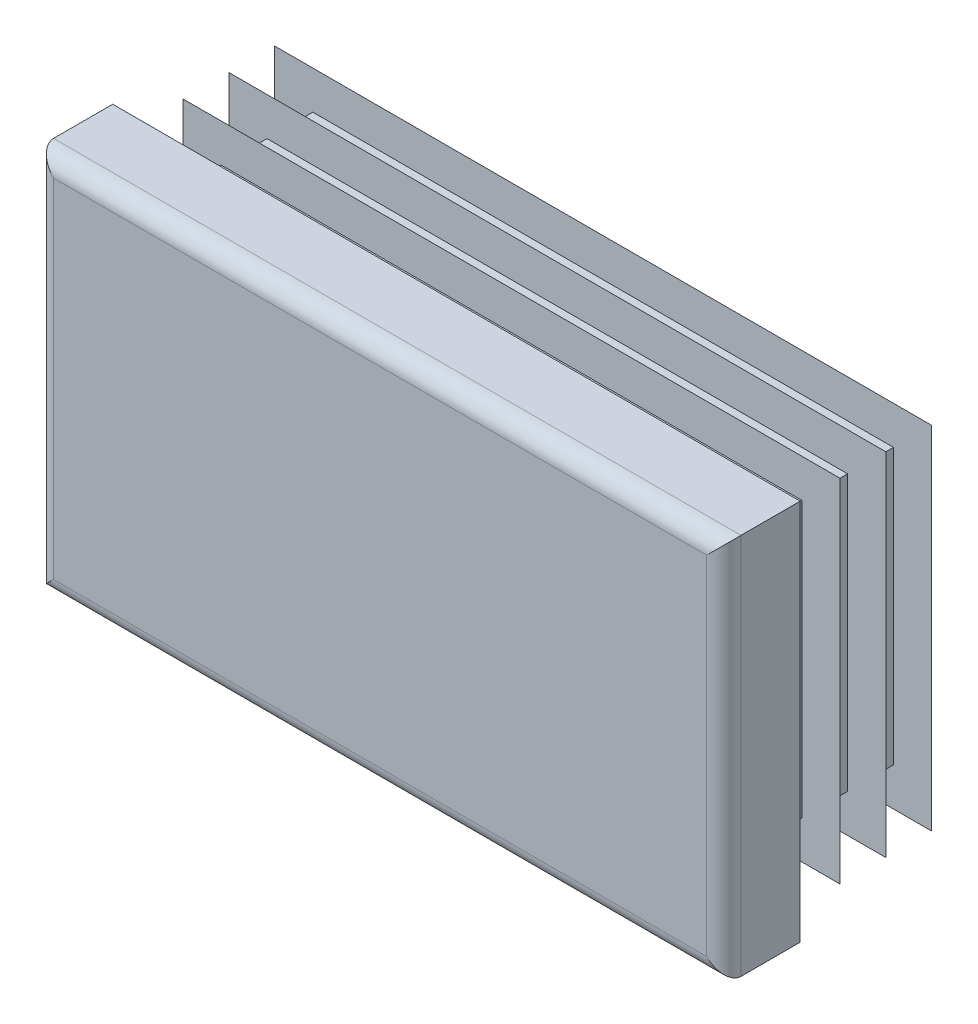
ISO-10303-21;
HEADER;
FILE_DESCRIPTION(('STEP AP214'),'2;1');
FILE_NAME('part.step','',(''),(''),'','','');
FILE_SCHEMA(('AUTOMOTIVE_DESIGN { 1 0 10303 214 1 1 1 1 }'));
ENDSEC;
DATA;
#1=APPLICATION_CONTEXT('core data for automotive mechanical design processes');
#2=APPLICATION_PROTOCOL_DEFINITION('international standard','automotive_design',2000,#1);
#3=PRODUCT_CONTEXT('',#1,'mechanical');
#4=PRODUCT('Part','Part','',(#3));
#5=PRODUCT_RELATED_PRODUCT_CATEGORY('part','',(#4));
#6=PRODUCT_DEFINITION_FORMATION('','',#4);
#7=PRODUCT_DEFINITION_CONTEXT('part definition',#1,'design');
#8=PRODUCT_DEFINITION('design','',#6,#7);
#9=PRODUCT_DEFINITION_SHAPE('','',#8);
#10=(LENGTH_UNIT() NAMED_UNIT(*) SI_UNIT(.MILLI.,.METRE.));
#11=(NAMED_UNIT(*) PLANE_ANGLE_UNIT() SI_UNIT($,.RADIAN.));
#12=(NAMED_UNIT(*) SI_UNIT($,.STERADIAN.) SOLID_ANGLE_UNIT());
#13=UNCERTAINTY_MEASURE_WITH_UNIT(LENGTH_MEASURE(1.E-05),#10,'distance_accuracy_value','');
#14=(GEOMETRIC_REPRESENTATION_CONTEXT(3) GLOBAL_UNCERTAINTY_ASSIGNED_CONTEXT((#13)) GLOBAL_UNIT_ASSIGNED_CONTEXT((#10,
#11,#12)) REPRESENTATION_CONTEXT('',''));
#15=CARTESIAN_POINT('',(0.,0.,0.));
#16=DIRECTION('',(0.,0.,1.));
#17=DIRECTION('',(1.,0.,0.));
#18=AXIS2_PLACEMENT_3D('',#15,#16,#17);
#19=CARTESIAN_POINT('',(21.375,-12.5,5.));
#20=DIRECTION('',(0.,0.,-1.));
#21=DIRECTION('',(0.,1.,0.));
#22=AXIS2_PLACEMENT_3D('',#19,#20,#21);
#23=PLANE('',#22);
#24=DIRECTION('',(0.,1.,0.));
#25=VECTOR('',#24,1.);
#26=CARTESIAN_POINT('',(-21.375,-12.5,5.));
#27=LINE('',#26,#25);
#28=CARTESIAN_POINT('',(-21.375,-11.375,5.));
#29=VERTEX_POINT('',#28);
#30=CARTESIAN_POINT('',(-21.375,11.375,5.));
#31=VERTEX_POINT('',#30);
#32=EDGE_CURVE('E310',#29,#31,#27,.T.);
#33=ORIENTED_EDGE('',*,*,#32,.F.);
#34=DIRECTION('',(-1.,0.,0.));
#35=VECTOR('',#34,1.);
#36=CARTESIAN_POINT('',(22.5,-11.375,5.));
#37=LINE('',#36,#35);
#38=CARTESIAN_POINT('',(21.375,-11.375,5.));
#39=VERTEX_POINT('',#38);
#40=EDGE_CURVE('E482',#39,#29,#37,.T.);
#41=ORIENTED_EDGE('',*,*,#40,.F.);
#42=DIRECTION('',(0.,1.,0.));
#43=VECTOR('',#42,1.);
#44=CARTESIAN_POINT('',(21.375,-12.5,5.));
#45=LINE('',#44,#43);
#46=CARTESIAN_POINT('',(21.375,11.375,5.));
#47=VERTEX_POINT('',#46);
#48=EDGE_CURVE('E305',#39,#47,#45,.T.);
#49=ORIENTED_EDGE('',*,*,#48,.T.);
#50=DIRECTION('',(-1.,0.,0.));
#51=VECTOR('',#50,1.);
#52=CARTESIAN_POINT('',(22.5,11.375,5.));
#53=LINE('',#52,#51);
#54=EDGE_CURVE('E630',#47,#31,#53,.T.);
#55=ORIENTED_EDGE('',*,*,#54,.T.);
#56=EDGE_LOOP('',(#33,#41,#49,#55));
#57=FACE_BOUND('',#56,.T.);
#58=ADVANCED_FACE('F14',(#57),#23,.F.);
#59=CARTESIAN_POINT('',(-21.375,-12.5,3.875));
#60=DIRECTION('',(0.,1.,0.));
#61=DIRECTION('',(-1.,0.,0.));
#62=AXIS2_PLACEMENT_3D('',#59,#60,#61);
#63=CYLINDRICAL_SURFACE('',#62,1.125);
#64=DIRECTION('',(0.,1.,0.));
#65=VECTOR('',#64,1.);
#66=CARTESIAN_POINT('',(-22.5,-12.5,3.875));
#67=LINE('',#66,#65);
#68=CARTESIAN_POINT('',(-22.5,-12.5,3.875));
#69=VERTEX_POINT('',#68);
#70=CARTESIAN_POINT('',(-22.5,12.5,3.875));
#71=VERTEX_POINT('',#70);
#72=EDGE_CURVE('E402',#69,#71,#67,.T.);
#73=ORIENTED_EDGE('',*,*,#72,.F.);
#74=CARTESIAN_POINT('',(-21.375,-11.375,3.875));
#75=DIRECTION('',(-0.707106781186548,0.707106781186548,0.));
#76=DIRECTION('',(0.707106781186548,0.707106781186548,0.));
#77=AXIS2_PLACEMENT_3D('',#74,#75,#76);
#78=ELLIPSE('',#77,1.59099025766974,1.125);
#79=EDGE_CURVE('E59',#69,#29,#78,.T.);
#80=ORIENTED_EDGE('',*,*,#79,.T.);
#81=ORIENTED_EDGE('',*,*,#32,.T.);
#82=CARTESIAN_POINT('',(-21.375,11.375,3.875));
#83=DIRECTION('',(0.707106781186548,0.707106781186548,0.));
#84=DIRECTION('',(-0.707106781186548,0.707106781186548,0.));
#85=AXIS2_PLACEMENT_3D('',#82,#83,#84);
#86=ELLIPSE('',#85,1.59099025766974,1.125);
#87=EDGE_CURVE('E306',#31,#71,#86,.F.);
#88=ORIENTED_EDGE('',*,*,#87,.T.);
#89=EDGE_LOOP('',(#73,#80,#81,#88));
#90=FACE_BOUND('',#89,.T.);
#91=ADVANCED_FACE('F16',(#90),#63,.T.);
#92=CARTESIAN_POINT('',(-22.5,-12.5,3.875));
#93=DIRECTION('',(1.,0.,0.));
#94=DIRECTION('',(0.,1.,0.));
#95=AXIS2_PLACEMENT_3D('',#92,#93,#94);
#96=PLANE('',#95);
#97=DIRECTION('',(0.,0.,-1.));
#98=VECTOR('',#97,1.);
#99=CARTESIAN_POINT('',(-22.5,12.5,3.875));
#100=LINE('',#99,#98);
#101=CARTESIAN_POINT('',(-22.5,12.5,0.));
#102=VERTEX_POINT('',#101);
#103=EDGE_CURVE('E615',#71,#102,#100,.T.);
#104=ORIENTED_EDGE('',*,*,#103,.T.);
#105=DIRECTION('',(0.,1.,0.));
#106=VECTOR('',#105,1.);
#107=CARTESIAN_POINT('',(-22.5,-12.5,0.));
#108=LINE('',#107,#106);
#109=CARTESIAN_POINT('',(-22.5,-12.5,0.));
#110=VERTEX_POINT('',#109);
#111=EDGE_CURVE('E400',#110,#102,#108,.T.);
#112=ORIENTED_EDGE('',*,*,#111,.F.);
#113=DIRECTION('',(0.,0.,-1.));
#114=VECTOR('',#113,1.);
#115=CARTESIAN_POINT('',(-22.5,-12.5,3.875));
#116=LINE('',#115,#114);
#117=EDGE_CURVE('E616',#69,#110,#116,.T.);
#118=ORIENTED_EDGE('',*,*,#117,.F.);
#119=ORIENTED_EDGE('',*,*,#72,.T.);
#120=EDGE_LOOP('',(#104,#112,#118,#119));
#121=FACE_BOUND('',#120,.T.);
#122=ADVANCED_FACE('F697',(#121),#96,.F.);
#123=CARTESIAN_POINT('',(-19.,-12.5,0.));
#124=DIRECTION('',(1.,0.,0.));
#125=DIRECTION('',(0.,1.,0.));
#126=AXIS2_PLACEMENT_3D('',#123,#124,#125);
#127=PLANE('',#126);
#128=DIRECTION('',(0.,1.,0.));
#129=VECTOR('',#128,1.);
#130=CARTESIAN_POINT('',(-19.,-12.5,0.));
#131=LINE('',#130,#129);
#132=CARTESIAN_POINT('',(-19.,-9.,0.));
#133=VERTEX_POINT('',#132);
#134=CARTESIAN_POINT('',(-19.,9.,0.));
#135=VERTEX_POINT('',#134);
#136=EDGE_CURVE('E397',#133,#135,#131,.T.);
#137=ORIENTED_EDGE('',*,*,#136,.T.);
#138=DIRECTION('',(0.,0.,-1.));
#139=VECTOR('',#138,1.);
#140=CARTESIAN_POINT('',(-19.,9.,0.));
#141=LINE('',#140,#139);
#142=CARTESIAN_POINT('',(-19.,9.,-0.6));
#143=VERTEX_POINT('',#142);
#144=EDGE_CURVE('E495',#135,#143,#141,.T.);
#145=ORIENTED_EDGE('',*,*,#144,.T.);
#146=DIRECTION('',(0.,1.,0.));
#147=VECTOR('',#146,1.);
#148=CARTESIAN_POINT('',(-19.,-12.5,-0.6));
#149=LINE('',#148,#147);
#150=CARTESIAN_POINT('',(-19.,-9.,-0.6));
#151=VERTEX_POINT('',#150);
#152=EDGE_CURVE('E394',#151,#143,#149,.T.);
#153=ORIENTED_EDGE('',*,*,#152,.F.);
#154=DIRECTION('',(0.,0.,1.));
#155=VECTOR('',#154,1.);
#156=CARTESIAN_POINT('',(-19.,-9.,0.));
#157=LINE('',#156,#155);
#158=EDGE_CURVE('E489',#151,#133,#157,.T.);
#159=ORIENTED_EDGE('',*,*,#158,.T.);
#160=EDGE_LOOP('',(#137,#145,#153,#159));
#161=FACE_BOUND('',#160,.T.);
#162=ADVANCED_FACE('F787',(#161),#127,.F.);
#163=CARTESIAN_POINT('',(-21.5,-12.5,-0.6));
#164=DIRECTION('',(0.342020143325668,0.,0.939692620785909));
#165=DIRECTION('',(-0.939692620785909,0.,0.342020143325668));
#166=AXIS2_PLACEMENT_3D('',#163,#164,#165);
#167=PLANE('',#166);
#168=DIRECTION('',(0.,1.,0.));
#169=VECTOR('',#168,1.);
#170=CARTESIAN_POINT('',(-21.5,-12.5,-0.6));
#171=LINE('',#170,#169);
#172=CARTESIAN_POINT('',(-21.5,-11.5,-0.6));
#173=VERTEX_POINT('',#172);
#174=CARTESIAN_POINT('',(-21.5,11.5,-0.6));
#175=VERTEX_POINT('',#174);
#176=EDGE_CURVE('E392',#173,#175,#171,.T.);
#177=ORIENTED_EDGE('',*,*,#176,.T.);
#178=DIRECTION('',(0.844349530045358,-0.43889572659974,-0.307318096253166));
#179=VECTOR('',#178,1.);
#180=CARTESIAN_POINT('',(-12.6060463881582,6.87689298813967,-3.83713437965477));
#181=LINE('',#180,#179);
#182=CARTESIAN_POINT('',(-19.,10.2004915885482,-1.5099255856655));
#183=VERTEX_POINT('',#182);
#184=EDGE_CURVE('E519',#175,#183,#181,.T.);
#185=ORIENTED_EDGE('',*,*,#184,.T.);
#186=DIRECTION('',(0.,1.,0.));
#187=VECTOR('',#186,1.);
#188=CARTESIAN_POINT('',(-19.,-12.5,-1.5099255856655));
#189=LINE('',#188,#187);
#190=CARTESIAN_POINT('',(-19.,-10.2004915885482,-1.5099255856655));
#191=VERTEX_POINT('',#190);
#192=EDGE_CURVE('E389',#191,#183,#189,.T.);
#193=ORIENTED_EDGE('',*,*,#192,.F.);
#194=DIRECTION('',(-0.844349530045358,-0.438895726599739,0.307318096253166));
#195=VECTOR('',#194,1.);
#196=CARTESIAN_POINT('',(-21.8705814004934,-11.6926294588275,-0.465119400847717));
#197=LINE('',#196,#195);
#198=EDGE_CURVE('E507',#191,#173,#197,.T.);
#199=ORIENTED_EDGE('',*,*,#198,.T.);
#200=EDGE_LOOP('',(#177,#185,#193,#199));
#201=FACE_BOUND('',#200,.T.);
#202=ADVANCED_FACE('F783',(#201),#167,.F.);
#203=CARTESIAN_POINT('',(-19.,-12.5,-1.5099255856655));
#204=DIRECTION('',(1.,0.,0.));
#205=DIRECTION('',(0.,1.,0.));
#206=AXIS2_PLACEMENT_3D('',#203,#204,#205);
#207=PLANE('',#206);
#208=ORIENTED_EDGE('',*,*,#192,.T.);
#209=DIRECTION('',(0.,-0.819152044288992,-0.573576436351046));
#210=VECTOR('',#209,1.);
#211=CARTESIAN_POINT('',(-19.,-5.0317668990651,-12.1756678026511));
#212=LINE('',#211,#210);
#213=CARTESIAN_POINT('',(-19.,9.,-2.35051884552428));
#214=VERTEX_POINT('',#213);
#215=EDGE_CURVE('E516',#183,#214,#212,.T.);
#216=ORIENTED_EDGE('',*,*,#215,.T.);
#217=DIRECTION('',(0.,0.,-1.));
#218=VECTOR('',#217,1.);
#219=CARTESIAN_POINT('',(-19.,9.,-1.5099255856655));
#220=LINE('',#219,#218);
#221=CARTESIAN_POINT('',(-19.,9.,-3.6));
#222=VERTEX_POINT('',#221);
#223=EDGE_CURVE('E525',#214,#222,#220,.T.);
#224=ORIENTED_EDGE('',*,*,#223,.T.);
#225=DIRECTION('',(0.,1.,0.));
#226=VECTOR('',#225,1.);
#227=CARTESIAN_POINT('',(-19.,-12.5,-3.6));
#228=LINE('',#227,#226);
#229=CARTESIAN_POINT('',(-19.,-9.,-3.6));
#230=VERTEX_POINT('',#229);
#231=EDGE_CURVE('E386',#230,#222,#228,.T.);
#232=ORIENTED_EDGE('',*,*,#231,.F.);
#233=DIRECTION('',(0.,0.,1.));
#234=VECTOR('',#233,1.);
#235=CARTESIAN_POINT('',(-19.,-9.,-1.5099255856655));
#236=LINE('',#235,#234);
#237=CARTESIAN_POINT('',(-19.,-9.,-2.35051884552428));
#238=VERTEX_POINT('',#237);
#239=EDGE_CURVE('E522',#230,#238,#236,.T.);
#240=ORIENTED_EDGE('',*,*,#239,.T.);
#241=DIRECTION('',(0.,-0.819152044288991,0.573576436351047));
#242=VECTOR('',#241,1.);
#243=CARTESIAN_POINT('',(-19.,-11.7434848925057,-0.429510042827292));
#244=LINE('',#243,#242);
#245=EDGE_CURVE('E504',#238,#191,#244,.T.);
#246=ORIENTED_EDGE('',*,*,#245,.T.);
#247=EDGE_LOOP('',(#208,#216,#224,#232,#240,#246));
#248=FACE_BOUND('',#247,.T.);
#249=ADVANCED_FACE('F779',(#248),#207,.F.);
#250=CARTESIAN_POINT('',(-21.5,-12.5,-3.6));
#251=DIRECTION('',(0.34202014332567,0.,0.939692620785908));
#252=DIRECTION('',(-0.939692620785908,0.,0.34202014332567));
#253=AXIS2_PLACEMENT_3D('',#250,#251,#252);
#254=PLANE('',#253);
#255=DIRECTION('',(0.,1.,0.));
#256=VECTOR('',#255,1.);
#257=CARTESIAN_POINT('',(-21.5,-12.5,-3.6));
#258=LINE('',#257,#256);
#259=CARTESIAN_POINT('',(-21.5,-11.5,-3.6));
#260=VERTEX_POINT('',#259);
#261=CARTESIAN_POINT('',(-21.5,11.5,-3.6));
#262=VERTEX_POINT('',#261);
#263=EDGE_CURVE('E384',#260,#262,#258,.T.);
#264=ORIENTED_EDGE('',*,*,#263,.T.);
#265=DIRECTION('',(0.844349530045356,-0.438895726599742,-0.307318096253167));
#266=VECTOR('',#265,1.);
#267=CARTESIAN_POINT('',(-12.6060463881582,6.87689298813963,-6.8371343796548));
#268=LINE('',#267,#266);
#269=CARTESIAN_POINT('',(-19.,10.2004915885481,-4.50992558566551));
#270=VERTEX_POINT('',#269);
#271=EDGE_CURVE('E549',#262,#270,#268,.T.);
#272=ORIENTED_EDGE('',*,*,#271,.T.);
#273=DIRECTION('',(0.,1.,0.));
#274=VECTOR('',#273,1.);
#275=CARTESIAN_POINT('',(-19.,-12.5,-4.50992558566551));
#276=LINE('',#275,#274);
#277=CARTESIAN_POINT('',(-19.,-10.2004915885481,-4.50992558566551));
#278=VERTEX_POINT('',#277);
#279=EDGE_CURVE('E381',#278,#270,#276,.T.);
#280=ORIENTED_EDGE('',*,*,#279,.F.);
#281=DIRECTION('',(-0.844349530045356,-0.438895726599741,0.307318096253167));
#282=VECTOR('',#281,1.);
#283=CARTESIAN_POINT('',(-21.8705814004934,-11.6926294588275,-3.46511940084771));
#284=LINE('',#283,#282);
#285=EDGE_CURVE('E537',#278,#260,#284,.T.);
#286=ORIENTED_EDGE('',*,*,#285,.T.);
#287=EDGE_LOOP('',(#264,#272,#280,#286));
#288=FACE_BOUND('',#287,.T.);
#289=ADVANCED_FACE('F775',(#288),#254,.F.);
#290=CARTESIAN_POINT('',(-19.,-12.5,-4.50992558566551));
#291=DIRECTION('',(1.,0.,0.));
#292=DIRECTION('',(0.,1.,0.));
#293=AXIS2_PLACEMENT_3D('',#290,#291,#292);
#294=PLANE('',#293);
#295=ORIENTED_EDGE('',*,*,#279,.T.);
#296=DIRECTION('',(0.,-0.819152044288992,-0.573576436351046));
#297=VECTOR('',#296,1.);
#298=CARTESIAN_POINT('',(-19.,-5.03176689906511,-15.1756678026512));
#299=LINE('',#298,#297);
#300=CARTESIAN_POINT('',(-19.,9.,-5.35051884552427));
#301=VERTEX_POINT('',#300);
#302=EDGE_CURVE('E546',#270,#301,#299,.T.);
#303=ORIENTED_EDGE('',*,*,#302,.T.);
#304=DIRECTION('',(0.,0.,-1.));
#305=VECTOR('',#304,1.);
#306=CARTESIAN_POINT('',(-19.,9.,-4.50992558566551));
#307=LINE('',#306,#305);
#308=CARTESIAN_POINT('',(-19.,9.,-6.6));
#309=VERTEX_POINT('',#308);
#310=EDGE_CURVE('E555',#301,#309,#307,.T.);
#311=ORIENTED_EDGE('',*,*,#310,.T.);
#312=DIRECTION('',(0.,1.,0.));
#313=VECTOR('',#312,1.);
#314=CARTESIAN_POINT('',(-19.,-12.5,-6.6));
#315=LINE('',#314,#313);
#316=CARTESIAN_POINT('',(-19.,-9.,-6.6));
#317=VERTEX_POINT('',#316);
#318=EDGE_CURVE('E378',#317,#309,#315,.T.);
#319=ORIENTED_EDGE('',*,*,#318,.F.);
#320=DIRECTION('',(0.,0.,1.));
#321=VECTOR('',#320,1.);
#322=CARTESIAN_POINT('',(-19.,-9.,-4.50992558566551));
#323=LINE('',#322,#321);
#324=CARTESIAN_POINT('',(-19.,-9.,-5.35051884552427));
#325=VERTEX_POINT('',#324);
#326=EDGE_CURVE('E552',#317,#325,#323,.T.);
#327=ORIENTED_EDGE('',*,*,#326,.T.);
#328=DIRECTION('',(0.,-0.819152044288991,0.573576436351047));
#329=VECTOR('',#328,1.);
#330=CARTESIAN_POINT('',(-19.,-11.7434848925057,-3.42951004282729));
#331=LINE('',#330,#329);
#332=EDGE_CURVE('E534',#325,#278,#331,.T.);
#333=ORIENTED_EDGE('',*,*,#332,.T.);
#334=EDGE_LOOP('',(#295,#303,#311,#319,#327,#333));
#335=FACE_BOUND('',#334,.T.);
#336=ADVANCED_FACE('F771',(#335),#294,.F.);
#337=CARTESIAN_POINT('',(-21.5,-12.5,-6.6));
#338=DIRECTION('',(0.34202014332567,0.,0.939692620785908));
#339=DIRECTION('',(-0.939692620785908,0.,0.34202014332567));
#340=AXIS2_PLACEMENT_3D('',#337,#338,#339);
#341=PLANE('',#340);
#342=DIRECTION('',(0.,1.,0.));
#343=VECTOR('',#342,1.);
#344=CARTESIAN_POINT('',(-21.5,-12.5,-6.6));
#345=LINE('',#344,#343);
#346=CARTESIAN_POINT('',(-21.5,-11.5,-6.6));
#347=VERTEX_POINT('',#346);
#348=CARTESIAN_POINT('',(-21.5,11.5,-6.6));
#349=VERTEX_POINT('',#348);
#350=EDGE_CURVE('E376',#347,#349,#345,.T.);
#351=ORIENTED_EDGE('',*,*,#350,.T.);
#352=DIRECTION('',(0.844349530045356,-0.438895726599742,-0.307318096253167));
#353=VECTOR('',#352,1.);
#354=CARTESIAN_POINT('',(-12.6060463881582,6.87689298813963,-9.8371343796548));
#355=LINE('',#354,#353);
#356=CARTESIAN_POINT('',(-19.,10.2004915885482,-7.50992558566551));
#357=VERTEX_POINT('',#356);
#358=EDGE_CURVE('E579',#349,#357,#355,.T.);
#359=ORIENTED_EDGE('',*,*,#358,.T.);
#360=DIRECTION('',(0.,1.,0.));
#361=VECTOR('',#360,1.);
#362=CARTESIAN_POINT('',(-19.,-12.5,-7.50992558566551));
#363=LINE('',#362,#361);
#364=CARTESIAN_POINT('',(-19.,-10.2004915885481,-7.50992558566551));
#365=VERTEX_POINT('',#364);
#366=EDGE_CURVE('E373',#365,#357,#363,.T.);
#367=ORIENTED_EDGE('',*,*,#366,.F.);
#368=DIRECTION('',(-0.844349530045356,-0.438895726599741,0.307318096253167));
#369=VECTOR('',#368,1.);
#370=CARTESIAN_POINT('',(-21.8705814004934,-11.6926294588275,-6.46511940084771));
#371=LINE('',#370,#369);
#372=EDGE_CURVE('E567',#365,#347,#371,.T.);
#373=ORIENTED_EDGE('',*,*,#372,.T.);
#374=EDGE_LOOP('',(#351,#359,#367,#373));
#375=FACE_BOUND('',#374,.T.);
#376=ADVANCED_FACE('F767',(#375),#341,.F.);
#377=CARTESIAN_POINT('',(-19.,-12.5,-7.50992558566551));
#378=DIRECTION('',(1.,0.,0.));
#379=DIRECTION('',(0.,1.,0.));
#380=AXIS2_PLACEMENT_3D('',#377,#378,#379);
#381=PLANE('',#380);
#382=ORIENTED_EDGE('',*,*,#366,.T.);
#383=DIRECTION('',(0.,-0.819152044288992,-0.573576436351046));
#384=VECTOR('',#383,1.);
#385=CARTESIAN_POINT('',(-19.,-5.03176689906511,-18.1756678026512));
#386=LINE('',#385,#384);
#387=CARTESIAN_POINT('',(-19.,9.,-8.35051884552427));
#388=VERTEX_POINT('',#387);
#389=EDGE_CURVE('E576',#357,#388,#386,.T.);
#390=ORIENTED_EDGE('',*,*,#389,.T.);
#391=DIRECTION('',(0.,0.,-1.));
#392=VECTOR('',#391,1.);
#393=CARTESIAN_POINT('',(-19.,9.,-7.50992558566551));
#394=LINE('',#393,#392);
#395=CARTESIAN_POINT('',(-19.,9.,-9.6));
#396=VERTEX_POINT('',#395);
#397=EDGE_CURVE('E585',#388,#396,#394,.T.);
#398=ORIENTED_EDGE('',*,*,#397,.T.);
#399=DIRECTION('',(0.,1.,0.));
#400=VECTOR('',#399,1.);
#401=CARTESIAN_POINT('',(-19.,-12.5,-9.6));
#402=LINE('',#401,#400);
#403=CARTESIAN_POINT('',(-19.,-9.,-9.6));
#404=VERTEX_POINT('',#403);
#405=EDGE_CURVE('E370',#404,#396,#402,.T.);
#406=ORIENTED_EDGE('',*,*,#405,.F.);
#407=DIRECTION('',(0.,0.,1.));
#408=VECTOR('',#407,1.);
#409=CARTESIAN_POINT('',(-19.,-9.,-7.50992558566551));
#410=LINE('',#409,#408);
#411=CARTESIAN_POINT('',(-19.,-9.,-8.35051884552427));
#412=VERTEX_POINT('',#411);
#413=EDGE_CURVE('E582',#404,#412,#410,.T.);
#414=ORIENTED_EDGE('',*,*,#413,.T.);
#415=DIRECTION('',(0.,-0.819152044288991,0.573576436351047));
#416=VECTOR('',#415,1.);
#417=CARTESIAN_POINT('',(-19.,-11.7434848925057,-6.42951004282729));
#418=LINE('',#417,#416);
#419=EDGE_CURVE('E564',#412,#365,#418,.T.);
#420=ORIENTED_EDGE('',*,*,#419,.T.);
#421=EDGE_LOOP('',(#382,#390,#398,#406,#414,#420));
#422=FACE_BOUND('',#421,.T.);
#423=ADVANCED_FACE('F764',(#422),#381,.F.);
#424=CARTESIAN_POINT('',(-21.5,-12.5,-9.6));
#425=DIRECTION('',(0.342020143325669,0.,0.939692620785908));
#426=DIRECTION('',(-0.939692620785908,0.,0.342020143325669));
#427=AXIS2_PLACEMENT_3D('',#424,#425,#426);
#428=PLANE('',#427);
#429=DIRECTION('',(0.,1.,0.));
#430=VECTOR('',#429,1.);
#431=CARTESIAN_POINT('',(-21.5,-12.5,-9.6));
#432=LINE('',#431,#430);
#433=CARTESIAN_POINT('',(-21.5,-11.5,-9.6));
#434=VERTEX_POINT('',#433);
#435=CARTESIAN_POINT('',(-21.5,11.5,-9.6));
#436=VERTEX_POINT('',#435);
#437=EDGE_CURVE('E368',#434,#436,#432,.T.);
#438=ORIENTED_EDGE('',*,*,#437,.T.);
#439=DIRECTION('',(0.844349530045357,-0.438895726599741,-0.307318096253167));
#440=VECTOR('',#439,1.);
#441=CARTESIAN_POINT('',(-12.6060463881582,6.87689298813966,-12.8371343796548));
#442=LINE('',#441,#440);
#443=CARTESIAN_POINT('',(-19.,10.2004915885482,-10.5099255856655));
#444=VERTEX_POINT('',#443);
#445=EDGE_CURVE('E607',#436,#444,#442,.T.);
#446=ORIENTED_EDGE('',*,*,#445,.T.);
#447=DIRECTION('',(0.,1.,0.));
#448=VECTOR('',#447,1.);
#449=CARTESIAN_POINT('',(-19.,-12.5,-10.5099255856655));
#450=LINE('',#449,#448);
#451=CARTESIAN_POINT('',(-19.,-10.2004915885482,-10.5099255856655));
#452=VERTEX_POINT('',#451);
#453=EDGE_CURVE('E365',#452,#444,#450,.T.);
#454=ORIENTED_EDGE('',*,*,#453,.F.);
#455=DIRECTION('',(-0.844349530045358,-0.438895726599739,0.307318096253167));
#456=VECTOR('',#455,1.);
#457=CARTESIAN_POINT('',(-21.8705814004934,-11.6926294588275,-9.46511940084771));
#458=LINE('',#457,#456);
#459=EDGE_CURVE('E595',#452,#434,#458,.T.);
#460=ORIENTED_EDGE('',*,*,#459,.T.);
#461=EDGE_LOOP('',(#438,#446,#454,#460));
#462=FACE_BOUND('',#461,.T.);
#463=ADVANCED_FACE('F675',(#462),#428,.F.);
#464=CARTESIAN_POINT('',(-19.,-12.5,-10.5099255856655));
#465=DIRECTION('',(1.,0.,0.));
#466=DIRECTION('',(0.,1.,0.));
#467=AXIS2_PLACEMENT_3D('',#464,#465,#466);
#468=PLANE('',#467);
#469=ORIENTED_EDGE('',*,*,#453,.T.);
#470=DIRECTION('',(0.,-0.819152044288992,-0.573576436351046));
#471=VECTOR('',#470,1.);
#472=CARTESIAN_POINT('',(-19.,-5.0317668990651,-21.1756678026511));
#473=LINE('',#472,#471);
#474=CARTESIAN_POINT('',(-19.,9.,-11.3505188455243));
#475=VERTEX_POINT('',#474);
#476=EDGE_CURVE('E604',#444,#475,#473,.T.);
#477=ORIENTED_EDGE('',*,*,#476,.T.);
#478=DIRECTION('',(0.,0.,-1.));
#479=VECTOR('',#478,1.);
#480=CARTESIAN_POINT('',(-19.,9.,-10.5099255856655));
#481=LINE('',#480,#479);
#482=CARTESIAN_POINT('',(-19.,9.,-12.));
#483=VERTEX_POINT('',#482);
#484=EDGE_CURVE('E613',#475,#483,#481,.T.);
#485=ORIENTED_EDGE('',*,*,#484,.T.);
#486=DIRECTION('',(0.,1.,0.));
#487=VECTOR('',#486,1.);
#488=CARTESIAN_POINT('',(-19.,-12.5,-12.));
#489=LINE('',#488,#487);
#490=CARTESIAN_POINT('',(-19.,-9.,-12.));
#491=VERTEX_POINT('',#490);
#492=EDGE_CURVE('E362',#491,#483,#489,.T.);
#493=ORIENTED_EDGE('',*,*,#492,.F.);
#494=DIRECTION('',(0.,0.,1.));
#495=VECTOR('',#494,1.);
#496=CARTESIAN_POINT('',(-19.,-9.,-10.5099255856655));
#497=LINE('',#496,#495);
#498=CARTESIAN_POINT('',(-19.,-9.,-11.3505188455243));
#499=VERTEX_POINT('',#498);
#500=EDGE_CURVE('E610',#491,#499,#497,.T.);
#501=ORIENTED_EDGE('',*,*,#500,.T.);
#502=DIRECTION('',(0.,-0.81915204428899,0.573576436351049));
#503=VECTOR('',#502,1.);
#504=CARTESIAN_POINT('',(-19.,-11.7434848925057,-9.42951004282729));
#505=LINE('',#504,#503);
#506=EDGE_CURVE('E592',#499,#452,#505,.T.);
#507=ORIENTED_EDGE('',*,*,#506,.T.);
#508=EDGE_LOOP('',(#469,#477,#485,#493,#501,#507));
#509=FACE_BOUND('',#508,.T.);
#510=ADVANCED_FACE('F677',(#509),#468,.F.);
#511=CARTESIAN_POINT('',(-19.,-12.5,-12.));
#512=DIRECTION('',(0.,0.,1.));
#513=DIRECTION('',(0.,-1.,0.));
#514=AXIS2_PLACEMENT_3D('',#511,#512,#513);
#515=PLANE('',#514);
#516=ORIENTED_EDGE('',*,*,#492,.T.);
#517=DIRECTION('',(-1.,0.,0.));
#518=VECTOR('',#517,1.);
#519=CARTESIAN_POINT('',(22.5,9.,-12.));
#520=LINE('',#519,#518);
#521=CARTESIAN_POINT('',(19.,9.,-12.));
#522=VERTEX_POINT('',#521);
#523=EDGE_CURVE('E438',#522,#483,#520,.T.);
#524=ORIENTED_EDGE('',*,*,#523,.F.);
#525=DIRECTION('',(0.,1.,0.));
#526=VECTOR('',#525,1.);
#527=CARTESIAN_POINT('',(19.,-12.5,-12.));
#528=LINE('',#527,#526);
#529=CARTESIAN_POINT('',(19.,-9.,-12.));
#530=VERTEX_POINT('',#529);
#531=EDGE_CURVE('E359',#530,#522,#528,.T.);
#532=ORIENTED_EDGE('',*,*,#531,.F.);
#533=DIRECTION('',(-1.,0.,0.));
#534=VECTOR('',#533,1.);
#535=CARTESIAN_POINT('',(22.5,-9.,-12.));
#536=LINE('',#535,#534);
#537=EDGE_CURVE('E436',#530,#491,#536,.T.);
#538=ORIENTED_EDGE('',*,*,#537,.T.);
#539=EDGE_LOOP('',(#516,#524,#532,#538));
#540=FACE_BOUND('',#539,.T.);
#541=ADVANCED_FACE('F435',(#540),#515,.F.);
#542=CARTESIAN_POINT('',(19.,-12.5,-12.));
#543=DIRECTION('',(-1.,0.,0.));
#544=DIRECTION('',(0.,-1.,0.));
#545=AXIS2_PLACEMENT_3D('',#542,#543,#544);
#546=PLANE('',#545);
#547=DIRECTION('',(0.,0.,1.));
#548=VECTOR('',#547,1.);
#549=CARTESIAN_POINT('',(19.,9.,-12.));
#550=LINE('',#549,#548);
#551=CARTESIAN_POINT('',(19.,9.,-11.3505188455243));
#552=VERTEX_POINT('',#551);
#553=EDGE_CURVE('E9',#522,#552,#550,.T.);
#554=ORIENTED_EDGE('',*,*,#553,.T.);
#555=DIRECTION('',(0.,0.819152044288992,0.573576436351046));
#556=VECTOR('',#555,1.);
#557=CARTESIAN_POINT('',(19.,-5.73187286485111,-21.6658872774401));
#558=LINE('',#557,#556);
#559=CARTESIAN_POINT('',(19.,10.2004915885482,-10.5099255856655));
#560=VERTEX_POINT('',#559);
#561=EDGE_CURVE('E601',#552,#560,#558,.T.);
#562=ORIENTED_EDGE('',*,*,#561,.T.);
#563=DIRECTION('',(0.,1.,0.));
#564=VECTOR('',#563,1.);
#565=CARTESIAN_POINT('',(19.,-12.5,-10.5099255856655));
#566=LINE('',#565,#564);
#567=CARTESIAN_POINT('',(19.,-10.2004915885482,-10.5099255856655));
#568=VERTEX_POINT('',#567);
#569=EDGE_CURVE('E356',#568,#560,#566,.T.);
#570=ORIENTED_EDGE('',*,*,#569,.F.);
#571=DIRECTION('',(0.,0.81915204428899,-0.573576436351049));
#572=VECTOR('',#571,1.);
#573=CARTESIAN_POINT('',(19.,-11.0433789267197,-9.91972951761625));
#574=LINE('',#573,#572);
#575=CARTESIAN_POINT('',(19.,-9.,-11.3505188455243));
#576=VERTEX_POINT('',#575);
#577=EDGE_CURVE('E428',#568,#576,#574,.T.);
#578=ORIENTED_EDGE('',*,*,#577,.T.);
#579=DIRECTION('',(0.,0.,-1.));
#580=VECTOR('',#579,1.);
#581=CARTESIAN_POINT('',(19.,-9.,-12.));
#582=LINE('',#581,#580);
#583=EDGE_CURVE('E23',#576,#530,#582,.T.);
#584=ORIENTED_EDGE('',*,*,#583,.T.);
#585=ORIENTED_EDGE('',*,*,#531,.T.);
#586=EDGE_LOOP('',(#554,#562,#570,#578,#584,#585));
#587=FACE_BOUND('',#586,.T.);
#588=ADVANCED_FACE('F426',(#587),#546,.F.);
#589=CARTESIAN_POINT('',(19.,-12.5,-10.5099255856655));
#590=DIRECTION('',(-0.342020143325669,0.,0.939692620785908));
#591=DIRECTION('',(-0.939692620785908,0.,-0.342020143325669));
#592=AXIS2_PLACEMENT_3D('',#589,#590,#591);
#593=PLANE('',#592);
#594=ORIENTED_EDGE('',*,*,#569,.T.);
#595=DIRECTION('',(0.844349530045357,0.438895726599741,0.307318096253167));
#596=VECTOR('',#595,1.);
#597=CARTESIAN_POINT('',(10.587620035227,5.82770817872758,-13.5717814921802));
#598=LINE('',#597,#596);
#599=CARTESIAN_POINT('',(21.5,11.5,-9.6));
#600=VERTEX_POINT('',#599);
#601=EDGE_CURVE('E598',#560,#600,#598,.T.);
#602=ORIENTED_EDGE('',*,*,#601,.T.);
#603=DIRECTION('',(0.,1.,0.));
#604=VECTOR('',#603,1.);
#605=CARTESIAN_POINT('',(21.5,-12.5,-9.6));
#606=LINE('',#605,#604);
#607=CARTESIAN_POINT('',(21.5,-11.5,-9.6));
#608=VERTEX_POINT('',#607);
#609=EDGE_CURVE('E353',#608,#600,#606,.T.);
#610=ORIENTED_EDGE('',*,*,#609,.F.);
#611=DIRECTION('',(-0.844349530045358,0.438895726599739,-0.307318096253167));
#612=VECTOR('',#611,1.);
#613=CARTESIAN_POINT('',(19.8521550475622,-10.6434446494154,-10.1997665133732));
#614=LINE('',#613,#612);
#615=EDGE_CURVE('E588',#608,#568,#614,.T.);
#616=ORIENTED_EDGE('',*,*,#615,.T.);
#617=EDGE_LOOP('',(#594,#602,#610,#616));
#618=FACE_BOUND('',#617,.T.);
#619=ADVANCED_FACE('F752',(#618),#593,.F.);
#620=CARTESIAN_POINT('',(21.5,-12.5,-9.6));
#621=DIRECTION('',(0.,0.,-1.));
#622=DIRECTION('',(0.,1.,0.));
#623=AXIS2_PLACEMENT_3D('',#620,#621,#622);
#624=PLANE('',#623);
#625=ORIENTED_EDGE('',*,*,#609,.T.);
#626=DIRECTION('',(-1.,0.,0.));
#627=VECTOR('',#626,1.);
#628=CARTESIAN_POINT('',(22.5,11.5,-9.6));
#629=LINE('',#628,#627);
#630=EDGE_CURVE('E444',#600,#436,#629,.T.);
#631=ORIENTED_EDGE('',*,*,#630,.T.);
#632=ORIENTED_EDGE('',*,*,#437,.F.);
#633=DIRECTION('',(-1.,0.,0.));
#634=VECTOR('',#633,1.);
#635=CARTESIAN_POINT('',(22.5,-11.5,-9.6));
#636=LINE('',#635,#634);
#637=EDGE_CURVE('E451',#608,#434,#636,.T.);
#638=ORIENTED_EDGE('',*,*,#637,.F.);
#639=EDGE_LOOP('',(#625,#631,#632,#638));
#640=FACE_BOUND('',#639,.T.);
#641=ORIENTED_EDGE('',*,*,#405,.T.);
#642=DIRECTION('',(-1.,0.,0.));
#643=VECTOR('',#642,1.);
#644=CARTESIAN_POINT('',(22.5,9.,-9.6));
#645=LINE('',#644,#643);
#646=CARTESIAN_POINT('',(19.,9.,-9.6));
#647=VERTEX_POINT('',#646);
#648=EDGE_CURVE('E663',#647,#396,#645,.T.);
#649=ORIENTED_EDGE('',*,*,#648,.F.);
#650=DIRECTION('',(0.,1.,0.));
#651=VECTOR('',#650,1.);
#652=CARTESIAN_POINT('',(19.,-12.5,-9.6));
#653=LINE('',#652,#651);
#654=CARTESIAN_POINT('',(19.,-9.,-9.6));
#655=VERTEX_POINT('',#654);
#656=EDGE_CURVE('E350',#655,#647,#653,.T.);
#657=ORIENTED_EDGE('',*,*,#656,.F.);
#658=DIRECTION('',(-1.,0.,0.));
#659=VECTOR('',#658,1.);
#660=CARTESIAN_POINT('',(22.5,-9.,-9.6));
#661=LINE('',#660,#659);
#662=EDGE_CURVE('E453',#655,#404,#661,.T.);
#663=ORIENTED_EDGE('',*,*,#662,.T.);
#664=EDGE_LOOP('',(#641,#649,#657,#663));
#665=FACE_BOUND('',#664,.T.);
#666=ADVANCED_FACE('F667',(#640,#665),#624,.F.);
#667=CARTESIAN_POINT('',(19.,-12.5,-9.6));
#668=DIRECTION('',(-1.,0.,0.));
#669=DIRECTION('',(0.,-1.,0.));
#670=AXIS2_PLACEMENT_3D('',#667,#668,#669);
#671=PLANE('',#670);
#672=DIRECTION('',(0.,0.,1.));
#673=VECTOR('',#672,1.);
#674=CARTESIAN_POINT('',(19.,9.,-9.6));
#675=LINE('',#674,#673);
#676=CARTESIAN_POINT('',(19.,9.,-8.35051884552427));
#677=VERTEX_POINT('',#676);
#678=EDGE_CURVE('E420',#647,#677,#675,.T.);
#679=ORIENTED_EDGE('',*,*,#678,.T.);
#680=DIRECTION('',(0.,0.819152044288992,0.573576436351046));
#681=VECTOR('',#680,1.);
#682=CARTESIAN_POINT('',(19.,-6.01378065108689,-18.8632812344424));
#683=LINE('',#682,#681);
#684=CARTESIAN_POINT('',(19.,10.2004915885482,-7.50992558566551));
#685=VERTEX_POINT('',#684);
#686=EDGE_CURVE('E573',#677,#685,#683,.T.);
#687=ORIENTED_EDGE('',*,*,#686,.T.);
#688=DIRECTION('',(0.,1.,0.));
#689=VECTOR('',#688,1.);
#690=CARTESIAN_POINT('',(19.,-12.5,-7.50992558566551));
#691=LINE('',#690,#689);
#692=CARTESIAN_POINT('',(19.,-10.2004915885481,-7.50992558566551));
#693=VERTEX_POINT('',#692);
#694=EDGE_CURVE('E347',#693,#685,#691,.T.);
#695=ORIENTED_EDGE('',*,*,#694,.F.);
#696=DIRECTION('',(0.,0.819152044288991,-0.573576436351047));
#697=VECTOR('',#696,1.);
#698=CARTESIAN_POINT('',(19.,-10.761471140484,-7.11712347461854));
#699=LINE('',#698,#697);
#700=CARTESIAN_POINT('',(19.,-9.,-8.35051884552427));
#701=VERTEX_POINT('',#700);
#702=EDGE_CURVE('E561',#693,#701,#699,.T.);
#703=ORIENTED_EDGE('',*,*,#702,.T.);
#704=DIRECTION('',(0.,0.,-1.));
#705=VECTOR('',#704,1.);
#706=CARTESIAN_POINT('',(19.,-9.,-9.6));
#707=LINE('',#706,#705);
#708=EDGE_CURVE('E417',#701,#655,#707,.T.);
#709=ORIENTED_EDGE('',*,*,#708,.T.);
#710=ORIENTED_EDGE('',*,*,#656,.T.);
#711=EDGE_LOOP('',(#679,#687,#695,#703,#709,#710));
#712=FACE_BOUND('',#711,.T.);
#713=ADVANCED_FACE('F745',(#712),#671,.F.);
#714=CARTESIAN_POINT('',(19.,-12.5,-7.50992558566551));
#715=DIRECTION('',(-0.342020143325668,0.,0.939692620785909));
#716=DIRECTION('',(-0.939692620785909,0.,-0.342020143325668));
#717=AXIS2_PLACEMENT_3D('',#714,#715,#716);
#718=PLANE('',#717);
#719=ORIENTED_EDGE('',*,*,#694,.T.);
#720=DIRECTION('',(0.844349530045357,0.43889572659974,0.307318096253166));
#721=VECTOR('',#720,1.);
#722=CARTESIAN_POINT('',(10.587620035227,5.82770817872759,-10.5717814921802));
#723=LINE('',#722,#721);
#724=CARTESIAN_POINT('',(21.5,11.5,-6.6));
#725=VERTEX_POINT('',#724);
#726=EDGE_CURVE('E570',#685,#725,#723,.T.);
#727=ORIENTED_EDGE('',*,*,#726,.T.);
#728=DIRECTION('',(0.,1.,0.));
#729=VECTOR('',#728,1.);
#730=CARTESIAN_POINT('',(21.5,-12.5,-6.6));
#731=LINE('',#730,#729);
#732=CARTESIAN_POINT('',(21.5,-11.5,-6.6));
#733=VERTEX_POINT('',#732);
#734=EDGE_CURVE('E344',#733,#725,#731,.T.);
#735=ORIENTED_EDGE('',*,*,#734,.F.);
#736=DIRECTION('',(-0.844349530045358,0.43889572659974,-0.307318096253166));
#737=VECTOR('',#736,1.);
#738=CARTESIAN_POINT('',(19.8521550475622,-10.6434446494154,-7.19976651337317));
#739=LINE('',#738,#737);
#740=EDGE_CURVE('E558',#733,#693,#739,.T.);
#741=ORIENTED_EDGE('',*,*,#740,.T.);
#742=EDGE_LOOP('',(#719,#727,#735,#741));
#743=FACE_BOUND('',#742,.T.);
#744=ADVANCED_FACE('F741',(#743),#718,.F.);
#745=CARTESIAN_POINT('',(21.5,-12.5,-6.6));
#746=DIRECTION('',(0.,0.,-1.));
#747=DIRECTION('',(0.,1.,0.));
#748=AXIS2_PLACEMENT_3D('',#745,#746,#747);
#749=PLANE('',#748);
#750=ORIENTED_EDGE('',*,*,#734,.T.);
#751=DIRECTION('',(-1.,0.,0.));
#752=VECTOR('',#751,1.);
#753=CARTESIAN_POINT('',(22.5,11.5,-6.6));
#754=LINE('',#753,#752);
#755=EDGE_CURVE('E657',#725,#349,#754,.T.);
#756=ORIENTED_EDGE('',*,*,#755,.T.);
#757=ORIENTED_EDGE('',*,*,#350,.F.);
#758=DIRECTION('',(-1.,0.,0.));
#759=VECTOR('',#758,1.);
#760=CARTESIAN_POINT('',(22.5,-11.5,-6.6));
#761=LINE('',#760,#759);
#762=EDGE_CURVE('E459',#733,#347,#761,.T.);
#763=ORIENTED_EDGE('',*,*,#762,.F.);
#764=EDGE_LOOP('',(#750,#756,#757,#763));
#765=FACE_BOUND('',#764,.T.);
#766=ORIENTED_EDGE('',*,*,#318,.T.);
#767=DIRECTION('',(-1.,0.,0.));
#768=VECTOR('',#767,1.);
#769=CARTESIAN_POINT('',(22.5,9.,-6.6));
#770=LINE('',#769,#768);
#771=CARTESIAN_POINT('',(19.,9.,-6.6));
#772=VERTEX_POINT('',#771);
#773=EDGE_CURVE('E655',#772,#309,#770,.T.);
#774=ORIENTED_EDGE('',*,*,#773,.F.);
#775=DIRECTION('',(0.,1.,0.));
#776=VECTOR('',#775,1.);
#777=CARTESIAN_POINT('',(19.,-12.5,-6.6));
#778=LINE('',#777,#776);
#779=CARTESIAN_POINT('',(19.,-9.,-6.6));
#780=VERTEX_POINT('',#779);
#781=EDGE_CURVE('E341',#780,#772,#778,.T.);
#782=ORIENTED_EDGE('',*,*,#781,.F.);
#783=DIRECTION('',(-1.,0.,0.));
#784=VECTOR('',#783,1.);
#785=CARTESIAN_POINT('',(22.5,-9.,-6.6));
#786=LINE('',#785,#784);
#787=EDGE_CURVE('E461',#780,#317,#786,.T.);
#788=ORIENTED_EDGE('',*,*,#787,.T.);
#789=EDGE_LOOP('',(#766,#774,#782,#788));
#790=FACE_BOUND('',#789,.T.);
#791=ADVANCED_FACE('F737',(#765,#790),#749,.F.);
#792=CARTESIAN_POINT('',(19.,-12.5,-6.6));
#793=DIRECTION('',(-1.,0.,0.));
#794=DIRECTION('',(0.,-1.,0.));
#795=AXIS2_PLACEMENT_3D('',#792,#793,#794);
#796=PLANE('',#795);
#797=DIRECTION('',(0.,0.,1.));
#798=VECTOR('',#797,1.);
#799=CARTESIAN_POINT('',(19.,9.,-6.6));
#800=LINE('',#799,#798);
#801=CARTESIAN_POINT('',(19.,9.,-5.35051884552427));
#802=VERTEX_POINT('',#801);
#803=EDGE_CURVE('E414',#772,#802,#800,.T.);
#804=ORIENTED_EDGE('',*,*,#803,.T.);
#805=DIRECTION('',(0.,0.819152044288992,0.573576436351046));
#806=VECTOR('',#805,1.);
#807=CARTESIAN_POINT('',(19.,-6.01378065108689,-15.8632812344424));
#808=LINE('',#807,#806);
#809=CARTESIAN_POINT('',(19.,10.2004915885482,-4.50992558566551));
#810=VERTEX_POINT('',#809);
#811=EDGE_CURVE('E543',#802,#810,#808,.T.);
#812=ORIENTED_EDGE('',*,*,#811,.T.);
#813=DIRECTION('',(0.,1.,0.));
#814=VECTOR('',#813,1.);
#815=CARTESIAN_POINT('',(19.,-12.5,-4.50992558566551));
#816=LINE('',#815,#814);
#817=CARTESIAN_POINT('',(19.,-10.2004915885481,-4.50992558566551));
#818=VERTEX_POINT('',#817);
#819=EDGE_CURVE('E338',#818,#810,#816,.T.);
#820=ORIENTED_EDGE('',*,*,#819,.F.);
#821=DIRECTION('',(0.,0.819152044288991,-0.573576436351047));
#822=VECTOR('',#821,1.);
#823=CARTESIAN_POINT('',(19.,-10.761471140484,-4.11712347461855));
#824=LINE('',#823,#822);
#825=CARTESIAN_POINT('',(19.,-9.,-5.35051884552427));
#826=VERTEX_POINT('',#825);
#827=EDGE_CURVE('E531',#818,#826,#824,.T.);
#828=ORIENTED_EDGE('',*,*,#827,.T.);
#829=DIRECTION('',(0.,0.,-1.));
#830=VECTOR('',#829,1.);
#831=CARTESIAN_POINT('',(19.,-9.,-6.6));
#832=LINE('',#831,#830);
#833=EDGE_CURVE('E411',#826,#780,#832,.T.);
#834=ORIENTED_EDGE('',*,*,#833,.T.);
#835=ORIENTED_EDGE('',*,*,#781,.T.);
#836=EDGE_LOOP('',(#804,#812,#820,#828,#834,#835));
#837=FACE_BOUND('',#836,.T.);
#838=ADVANCED_FACE('F733',(#837),#796,.F.);
#839=CARTESIAN_POINT('',(19.,-12.5,-4.50992558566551));
#840=DIRECTION('',(-0.342020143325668,0.,0.939692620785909));
#841=DIRECTION('',(-0.939692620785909,0.,-0.342020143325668));
#842=AXIS2_PLACEMENT_3D('',#839,#840,#841);
#843=PLANE('',#842);
#844=ORIENTED_EDGE('',*,*,#819,.T.);
#845=DIRECTION('',(0.844349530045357,0.43889572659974,0.307318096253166));
#846=VECTOR('',#845,1.);
#847=CARTESIAN_POINT('',(10.587620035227,5.82770817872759,-7.57178149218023));
#848=LINE('',#847,#846);
#849=CARTESIAN_POINT('',(21.5,11.5,-3.6));
#850=VERTEX_POINT('',#849);
#851=EDGE_CURVE('E540',#810,#850,#848,.T.);
#852=ORIENTED_EDGE('',*,*,#851,.T.);
#853=DIRECTION('',(0.,1.,0.));
#854=VECTOR('',#853,1.);
#855=CARTESIAN_POINT('',(21.5,-12.5,-3.6));
#856=LINE('',#855,#854);
#857=CARTESIAN_POINT('',(21.5,-11.5,-3.6));
#858=VERTEX_POINT('',#857);
#859=EDGE_CURVE('E335',#858,#850,#856,.T.);
#860=ORIENTED_EDGE('',*,*,#859,.F.);
#861=DIRECTION('',(-0.844349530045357,0.438895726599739,-0.307318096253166));
#862=VECTOR('',#861,1.);
#863=CARTESIAN_POINT('',(19.8521550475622,-10.6434446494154,-4.19976651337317));
#864=LINE('',#863,#862);
#865=EDGE_CURVE('E528',#858,#818,#864,.T.);
#866=ORIENTED_EDGE('',*,*,#865,.T.);
#867=EDGE_LOOP('',(#844,#852,#860,#866));
#868=FACE_BOUND('',#867,.T.);
#869=ADVANCED_FACE('F729',(#868),#843,.F.);
#870=CARTESIAN_POINT('',(21.5,-12.5,-3.6));
#871=DIRECTION('',(0.,0.,-1.));
#872=DIRECTION('',(0.,1.,0.));
#873=AXIS2_PLACEMENT_3D('',#870,#871,#872);
#874=PLANE('',#873);
#875=ORIENTED_EDGE('',*,*,#859,.T.);
#876=DIRECTION('',(-1.,0.,0.));
#877=VECTOR('',#876,1.);
#878=CARTESIAN_POINT('',(22.5,11.5,-3.6));
#879=LINE('',#878,#877);
#880=EDGE_CURVE('E649',#850,#262,#879,.T.);
#881=ORIENTED_EDGE('',*,*,#880,.T.);
#882=ORIENTED_EDGE('',*,*,#263,.F.);
#883=DIRECTION('',(-1.,0.,0.));
#884=VECTOR('',#883,1.);
#885=CARTESIAN_POINT('',(22.5,-11.5,-3.6));
#886=LINE('',#885,#884);
#887=EDGE_CURVE('E467',#858,#260,#886,.T.);
#888=ORIENTED_EDGE('',*,*,#887,.F.);
#889=EDGE_LOOP('',(#875,#881,#882,#888));
#890=FACE_BOUND('',#889,.T.);
#891=ORIENTED_EDGE('',*,*,#231,.T.);
#892=DIRECTION('',(-1.,0.,0.));
#893=VECTOR('',#892,1.);
#894=CARTESIAN_POINT('',(22.5,9.,-3.6));
#895=LINE('',#894,#893);
#896=CARTESIAN_POINT('',(19.,9.,-3.6));
#897=VERTEX_POINT('',#896);
#898=EDGE_CURVE('E647',#897,#222,#895,.T.);
#899=ORIENTED_EDGE('',*,*,#898,.F.);
#900=DIRECTION('',(0.,1.,0.));
#901=VECTOR('',#900,1.);
#902=CARTESIAN_POINT('',(19.,-12.5,-3.6));
#903=LINE('',#902,#901);
#904=CARTESIAN_POINT('',(19.,-9.,-3.6));
#905=VERTEX_POINT('',#904);
#906=EDGE_CURVE('E332',#905,#897,#903,.T.);
#907=ORIENTED_EDGE('',*,*,#906,.F.);
#908=DIRECTION('',(-1.,0.,0.));
#909=VECTOR('',#908,1.);
#910=CARTESIAN_POINT('',(22.5,-9.,-3.6));
#911=LINE('',#910,#909);
#912=EDGE_CURVE('E469',#905,#230,#911,.T.);
#913=ORIENTED_EDGE('',*,*,#912,.T.);
#914=EDGE_LOOP('',(#891,#899,#907,#913));
#915=FACE_BOUND('',#914,.T.);
#916=ADVANCED_FACE('F725',(#890,#915),#874,.F.);
#917=CARTESIAN_POINT('',(19.,-12.5,-3.6));
#918=DIRECTION('',(-1.,0.,0.));
#919=DIRECTION('',(0.,-1.,0.));
#920=AXIS2_PLACEMENT_3D('',#917,#918,#919);
#921=PLANE('',#920);
#922=DIRECTION('',(0.,0.,1.));
#923=VECTOR('',#922,1.);
#924=CARTESIAN_POINT('',(19.,9.,-3.6));
#925=LINE('',#924,#923);
#926=CARTESIAN_POINT('',(19.,9.,-2.35051884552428));
#927=VERTEX_POINT('',#926);
#928=EDGE_CURVE('E408',#897,#927,#925,.T.);
#929=ORIENTED_EDGE('',*,*,#928,.T.);
#930=DIRECTION('',(0.,0.819152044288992,0.573576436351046));
#931=VECTOR('',#930,1.);
#932=CARTESIAN_POINT('',(19.,-6.01378065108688,-12.8632812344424));
#933=LINE('',#932,#931);
#934=CARTESIAN_POINT('',(19.,10.2004915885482,-1.5099255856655));
#935=VERTEX_POINT('',#934);
#936=EDGE_CURVE('E513',#927,#935,#933,.T.);
#937=ORIENTED_EDGE('',*,*,#936,.T.);
#938=DIRECTION('',(0.,1.,0.));
#939=VECTOR('',#938,1.);
#940=CARTESIAN_POINT('',(19.,-12.5,-1.5099255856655));
#941=LINE('',#940,#939);
#942=CARTESIAN_POINT('',(19.,-10.2004915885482,-1.5099255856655));
#943=VERTEX_POINT('',#942);
#944=EDGE_CURVE('E329',#943,#935,#941,.T.);
#945=ORIENTED_EDGE('',*,*,#944,.F.);
#946=DIRECTION('',(0.,0.819152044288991,-0.573576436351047));
#947=VECTOR('',#946,1.);
#948=CARTESIAN_POINT('',(19.,-10.761471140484,-1.11712347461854));
#949=LINE('',#948,#947);
#950=CARTESIAN_POINT('',(19.,-9.,-2.35051884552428));
#951=VERTEX_POINT('',#950);
#952=EDGE_CURVE('E501',#943,#951,#949,.T.);
#953=ORIENTED_EDGE('',*,*,#952,.T.);
#954=DIRECTION('',(0.,0.,-1.));
#955=VECTOR('',#954,1.);
#956=CARTESIAN_POINT('',(19.,-9.,-3.6));
#957=LINE('',#956,#955);
#958=EDGE_CURVE('E405',#951,#905,#957,.T.);
#959=ORIENTED_EDGE('',*,*,#958,.T.);
#960=ORIENTED_EDGE('',*,*,#906,.T.);
#961=EDGE_LOOP('',(#929,#937,#945,#953,#959,#960));
#962=FACE_BOUND('',#961,.T.);
#963=ADVANCED_FACE('F721',(#962),#921,.F.);
#964=CARTESIAN_POINT('',(19.,-12.5,-1.5099255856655));
#965=DIRECTION('',(-0.342020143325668,0.,0.939692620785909));
#966=DIRECTION('',(-0.939692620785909,0.,-0.342020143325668));
#967=AXIS2_PLACEMENT_3D('',#964,#965,#966);
#968=PLANE('',#967);
#969=ORIENTED_EDGE('',*,*,#944,.T.);
#970=DIRECTION('',(0.844349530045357,0.43889572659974,0.307318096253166));
#971=VECTOR('',#970,1.);
#972=CARTESIAN_POINT('',(10.587620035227,5.8277081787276,-4.57178149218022));
#973=LINE('',#972,#971);
#974=CARTESIAN_POINT('',(21.5,11.5,-0.6));
#975=VERTEX_POINT('',#974);
#976=EDGE_CURVE('E510',#935,#975,#973,.T.);
#977=ORIENTED_EDGE('',*,*,#976,.T.);
#978=DIRECTION('',(0.,1.,0.));
#979=VECTOR('',#978,1.);
#980=CARTESIAN_POINT('',(21.5,-12.5,-0.6));
#981=LINE('',#980,#979);
#982=CARTESIAN_POINT('',(21.5,-11.5,-0.6));
#983=VERTEX_POINT('',#982);
#984=EDGE_CURVE('E326',#983,#975,#981,.T.);
#985=ORIENTED_EDGE('',*,*,#984,.F.);
#986=DIRECTION('',(-0.844349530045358,0.43889572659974,-0.307318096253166));
#987=VECTOR('',#986,1.);
#988=CARTESIAN_POINT('',(19.8521550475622,-10.6434446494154,-1.19976651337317));
#989=LINE('',#988,#987);
#990=EDGE_CURVE('E498',#983,#943,#989,.T.);
#991=ORIENTED_EDGE('',*,*,#990,.T.);
#992=EDGE_LOOP('',(#969,#977,#985,#991));
#993=FACE_BOUND('',#992,.T.);
#994=ADVANCED_FACE('F717',(#993),#968,.F.);
#995=CARTESIAN_POINT('',(21.5,-12.5,-0.6));
#996=DIRECTION('',(0.,0.,-1.));
#997=DIRECTION('',(0.,1.,0.));
#998=AXIS2_PLACEMENT_3D('',#995,#996,#997);
#999=PLANE('',#998);
#1000=ORIENTED_EDGE('',*,*,#984,.T.);
#1001=DIRECTION('',(-1.,0.,0.));
#1002=VECTOR('',#1001,1.);
#1003=CARTESIAN_POINT('',(22.5,11.5,-0.6));
#1004=LINE('',#1003,#1002);
#1005=EDGE_CURVE('E641',#975,#175,#1004,.T.);
#1006=ORIENTED_EDGE('',*,*,#1005,.T.);
#1007=ORIENTED_EDGE('',*,*,#176,.F.);
#1008=DIRECTION('',(-1.,0.,0.));
#1009=VECTOR('',#1008,1.);
#1010=CARTESIAN_POINT('',(22.5,-11.5,-0.6));
#1011=LINE('',#1010,#1009);
#1012=EDGE_CURVE('E475',#983,#173,#1011,.T.);
#1013=ORIENTED_EDGE('',*,*,#1012,.F.);
#1014=EDGE_LOOP('',(#1000,#1006,#1007,#1013));
#1015=FACE_BOUND('',#1014,.T.);
#1016=ORIENTED_EDGE('',*,*,#152,.T.);
#1017=DIRECTION('',(-1.,0.,0.));
#1018=VECTOR('',#1017,1.);
#1019=CARTESIAN_POINT('',(22.5,9.,-0.6));
#1020=LINE('',#1019,#1018);
#1021=CARTESIAN_POINT('',(19.,9.,-0.6));
#1022=VERTEX_POINT('',#1021);
#1023=EDGE_CURVE('E639',#1022,#143,#1020,.T.);
#1024=ORIENTED_EDGE('',*,*,#1023,.F.);
#1025=DIRECTION('',(0.,1.,0.));
#1026=VECTOR('',#1025,1.);
#1027=CARTESIAN_POINT('',(19.,-12.5,-0.6));
#1028=LINE('',#1027,#1026);
#1029=CARTESIAN_POINT('',(19.,-9.,-0.6));
#1030=VERTEX_POINT('',#1029);
#1031=EDGE_CURVE('E323',#1030,#1022,#1028,.T.);
#1032=ORIENTED_EDGE('',*,*,#1031,.F.);
#1033=DIRECTION('',(-1.,0.,0.));
#1034=VECTOR('',#1033,1.);
#1035=CARTESIAN_POINT('',(22.5,-9.,-0.6));
#1036=LINE('',#1035,#1034);
#1037=EDGE_CURVE('E477',#1030,#151,#1036,.T.);
#1038=ORIENTED_EDGE('',*,*,#1037,.T.);
#1039=EDGE_LOOP('',(#1016,#1024,#1032,#1038));
#1040=FACE_BOUND('',#1039,.T.);
#1041=ADVANCED_FACE('F713',(#1015,#1040),#999,.F.);
#1042=CARTESIAN_POINT('',(19.,-12.5,-0.6));
#1043=DIRECTION('',(-1.,0.,0.));
#1044=DIRECTION('',(0.,-1.,0.));
#1045=AXIS2_PLACEMENT_3D('',#1042,#1043,#1044);
#1046=PLANE('',#1045);
#1047=ORIENTED_EDGE('',*,*,#1031,.T.);
#1048=DIRECTION('',(0.,0.,1.));
#1049=VECTOR('',#1048,1.);
#1050=CARTESIAN_POINT('',(19.,9.,-0.6));
#1051=LINE('',#1050,#1049);
#1052=CARTESIAN_POINT('',(19.,9.,0.));
#1053=VERTEX_POINT('',#1052);
#1054=EDGE_CURVE('E492',#1022,#1053,#1051,.T.);
#1055=ORIENTED_EDGE('',*,*,#1054,.T.);
#1056=DIRECTION('',(0.,1.,0.));
#1057=VECTOR('',#1056,1.);
#1058=CARTESIAN_POINT('',(19.,-12.5,0.));
#1059=LINE('',#1058,#1057);
#1060=CARTESIAN_POINT('',(19.,-9.,0.));
#1061=VERTEX_POINT('',#1060);
#1062=EDGE_CURVE('E316',#1061,#1053,#1059,.T.);
#1063=ORIENTED_EDGE('',*,*,#1062,.F.);
#1064=DIRECTION('',(0.,0.,-1.));
#1065=VECTOR('',#1064,1.);
#1066=CARTESIAN_POINT('',(19.,-9.,-0.6));
#1067=LINE('',#1066,#1065);
#1068=EDGE_CURVE('E486',#1061,#1030,#1067,.T.);
#1069=ORIENTED_EDGE('',*,*,#1068,.T.);
#1070=EDGE_LOOP('',(#1047,#1055,#1063,#1069));
#1071=FACE_BOUND('',#1070,.T.);
#1072=ADVANCED_FACE('F709',(#1071),#1046,.F.);
#1073=CARTESIAN_POINT('',(19.,-12.5,0.));
#1074=DIRECTION('',(0.,0.,1.));
#1075=DIRECTION('',(0.,-1.,0.));
#1076=AXIS2_PLACEMENT_3D('',#1073,#1074,#1075);
#1077=PLANE('',#1076);
#1078=DIRECTION('',(-1.,0.,0.));
#1079=VECTOR('',#1078,1.);
#1080=CARTESIAN_POINT('',(22.5,9.,0.));
#1081=LINE('',#1080,#1079);
#1082=EDGE_CURVE('E634',#1053,#135,#1081,.T.);
#1083=ORIENTED_EDGE('',*,*,#1082,.T.);
#1084=ORIENTED_EDGE('',*,*,#136,.F.);
#1085=DIRECTION('',(-1.,0.,0.));
#1086=VECTOR('',#1085,1.);
#1087=CARTESIAN_POINT('',(22.5,-9.,0.));
#1088=LINE('',#1087,#1086);
#1089=EDGE_CURVE('E296',#1061,#133,#1088,.T.);
#1090=ORIENTED_EDGE('',*,*,#1089,.F.);
#1091=ORIENTED_EDGE('',*,*,#1062,.T.);
#1092=EDGE_LOOP('',(#1083,#1084,#1090,#1091));
#1093=FACE_BOUND('',#1092,.T.);
#1094=ORIENTED_EDGE('',*,*,#111,.T.);
#1095=DIRECTION('',(1.,0.,0.));
#1096=VECTOR('',#1095,1.);
#1097=CARTESIAN_POINT('',(19.,12.5,0.));
#1098=LINE('',#1097,#1096);
#1099=CARTESIAN_POINT('',(22.5,12.5,0.));
#1100=VERTEX_POINT('',#1099);
#1101=EDGE_CURVE('E621',#102,#1100,#1098,.T.);
#1102=ORIENTED_EDGE('',*,*,#1101,.T.);
#1103=DIRECTION('',(0.,1.,0.));
#1104=VECTOR('',#1103,1.);
#1105=CARTESIAN_POINT('',(22.5,-12.5,0.));
#1106=LINE('',#1105,#1104);
#1107=CARTESIAN_POINT('',(22.5,-12.5,0.));
#1108=VERTEX_POINT('',#1107);
#1109=EDGE_CURVE('E45',#1108,#1100,#1106,.T.);
#1110=ORIENTED_EDGE('',*,*,#1109,.F.);
#1111=DIRECTION('',(1.,0.,0.));
#1112=VECTOR('',#1111,1.);
#1113=CARTESIAN_POINT('',(-22.5,-12.5,0.));
#1114=LINE('',#1113,#1112);
#1115=EDGE_CURVE('E31',#110,#1108,#1114,.T.);
#1116=ORIENTED_EDGE('',*,*,#1115,.F.);
#1117=EDGE_LOOP('',(#1094,#1102,#1110,#1116));
#1118=FACE_BOUND('',#1117,.T.);
#1119=ADVANCED_FACE('F706',(#1093,#1118),#1077,.F.);
#1120=CARTESIAN_POINT('',(22.5,-12.5,0.));
#1121=DIRECTION('',(-1.,0.,0.));
#1122=DIRECTION('',(0.,-1.,0.));
#1123=AXIS2_PLACEMENT_3D('',#1120,#1121,#1122);
#1124=PLANE('',#1123);
#1125=DIRECTION('',(0.,0.,1.));
#1126=VECTOR('',#1125,1.);
#1127=CARTESIAN_POINT('',(22.5,12.5,0.));
#1128=LINE('',#1127,#1126);
#1129=CARTESIAN_POINT('',(22.5,12.5,3.875));
#1130=VERTEX_POINT('',#1129);
#1131=EDGE_CURVE('E314',#1100,#1130,#1128,.T.);
#1132=ORIENTED_EDGE('',*,*,#1131,.T.);
#1133=DIRECTION('',(0.,1.,0.));
#1134=VECTOR('',#1133,1.);
#1135=CARTESIAN_POINT('',(22.5,-12.5,3.875));
#1136=LINE('',#1135,#1134);
#1137=CARTESIAN_POINT('',(22.5,-12.5,3.875));
#1138=VERTEX_POINT('',#1137);
#1139=EDGE_CURVE('E303',#1138,#1130,#1136,.T.);
#1140=ORIENTED_EDGE('',*,*,#1139,.F.);
#1141=DIRECTION('',(0.,0.,1.));
#1142=VECTOR('',#1141,1.);
#1143=CARTESIAN_POINT('',(22.5,-12.5,0.));
#1144=LINE('',#1143,#1142);
#1145=EDGE_CURVE('E308',#1108,#1138,#1144,.T.);
#1146=ORIENTED_EDGE('',*,*,#1145,.F.);
#1147=ORIENTED_EDGE('',*,*,#1109,.T.);
#1148=EDGE_LOOP('',(#1132,#1140,#1146,#1147));
#1149=FACE_BOUND('',#1148,.T.);
#1150=ADVANCED_FACE('F312',(#1149),#1124,.F.);
#1151=CARTESIAN_POINT('',(21.375,-12.5,3.875));
#1152=DIRECTION('',(0.,1.,0.));
#1153=DIRECTION('',(-1.,0.,0.));
#1154=AXIS2_PLACEMENT_3D('',#1151,#1152,#1153);
#1155=CYLINDRICAL_SURFACE('',#1154,1.125);
#1156=ORIENTED_EDGE('',*,*,#48,.F.);
#1157=CARTESIAN_POINT('',(21.375,-11.375,3.875));
#1158=DIRECTION('',(0.707106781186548,0.707106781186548,0.));
#1159=DIRECTION('',(-0.707106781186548,0.707106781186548,0.));
#1160=AXIS2_PLACEMENT_3D('',#1157,#1158,#1159);
#1161=ELLIPSE('',#1160,1.59099025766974,1.125);
#1162=EDGE_CURVE('E293',#39,#1138,#1161,.T.);
#1163=ORIENTED_EDGE('',*,*,#1162,.T.);
#1164=ORIENTED_EDGE('',*,*,#1139,.T.);
#1165=CARTESIAN_POINT('',(21.375,11.375,3.875));
#1166=DIRECTION('',(-0.707106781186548,0.707106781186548,0.));
#1167=DIRECTION('',(0.707106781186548,0.707106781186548,0.));
#1168=AXIS2_PLACEMENT_3D('',#1165,#1166,#1167);
#1169=ELLIPSE('',#1168,1.59099025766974,1.125);
#1170=EDGE_CURVE('E52',#1130,#47,#1169,.F.);
#1171=ORIENTED_EDGE('',*,*,#1170,.T.);
#1172=EDGE_LOOP('',(#1156,#1163,#1164,#1171));
#1173=FACE_BOUND('',#1172,.T.);
#1174=ADVANCED_FACE('F301',(#1173),#1155,.T.);
#1175=CARTESIAN_POINT('',(-21.375,-12.5,3.875));
#1176=DIRECTION('',(0.,-1.,0.));
#1177=DIRECTION('',(1.,0.,0.));
#1178=AXIS2_PLACEMENT_3D('',#1175,#1176,#1177);
#1179=PLANE('',#1178);
#1180=DIRECTION('',(-1.,0.,0.));
#1181=VECTOR('',#1180,1.);
#1182=CARTESIAN_POINT('',(22.5,-12.5,3.875));
#1183=LINE('',#1182,#1181);
#1184=EDGE_CURVE('E290',#1138,#69,#1183,.T.);
#1185=ORIENTED_EDGE('',*,*,#1184,.T.);
#1186=ORIENTED_EDGE('',*,*,#117,.T.);
#1187=ORIENTED_EDGE('',*,*,#1115,.T.);
#1188=ORIENTED_EDGE('',*,*,#1145,.T.);
#1189=EDGE_LOOP('',(#1185,#1186,#1187,#1188));
#1190=FACE_BOUND('',#1189,.T.);
#1191=ADVANCED_FACE('F309',(#1190),#1179,.T.);
#1192=CARTESIAN_POINT('',(-21.375,12.5,3.875));
#1193=DIRECTION('',(0.,-1.,0.));
#1194=DIRECTION('',(1.,0.,0.));
#1195=AXIS2_PLACEMENT_3D('',#1192,#1193,#1194);
#1196=PLANE('',#1195);
#1197=ORIENTED_EDGE('',*,*,#103,.F.);
#1198=DIRECTION('',(-1.,0.,0.));
#1199=VECTOR('',#1198,1.);
#1200=CARTESIAN_POINT('',(22.5,12.5,3.875));
#1201=LINE('',#1200,#1199);
#1202=EDGE_CURVE('E631',#1130,#71,#1201,.T.);
#1203=ORIENTED_EDGE('',*,*,#1202,.F.);
#1204=ORIENTED_EDGE('',*,*,#1131,.F.);
#1205=ORIENTED_EDGE('',*,*,#1101,.F.);
#1206=EDGE_LOOP('',(#1197,#1203,#1204,#1205));
#1207=FACE_BOUND('',#1206,.T.);
#1208=ADVANCED_FACE('F700',(#1207),#1196,.F.);
#1209=CARTESIAN_POINT('',(22.5,9.,-0.6));
#1210=DIRECTION('',(0.,-1.,0.));
#1211=DIRECTION('',(1.,0.,0.));
#1212=AXIS2_PLACEMENT_3D('',#1209,#1210,#1211);
#1213=PLANE('',#1212);
#1214=ORIENTED_EDGE('',*,*,#1082,.F.);
#1215=ORIENTED_EDGE('',*,*,#1054,.F.);
#1216=ORIENTED_EDGE('',*,*,#1023,.T.);
#1217=ORIENTED_EDGE('',*,*,#144,.F.);
#1218=EDGE_LOOP('',(#1214,#1215,#1216,#1217));
#1219=FACE_BOUND('',#1218,.T.);
#1220=ADVANCED_FACE('F812',(#1219),#1213,.F.);
#1221=CARTESIAN_POINT('',(22.5,9.,-2.35051884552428));
#1222=DIRECTION('',(0.,-0.573576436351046,0.819152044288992));
#1223=DIRECTION('',(0.,-0.819152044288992,-0.573576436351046));
#1224=AXIS2_PLACEMENT_3D('',#1221,#1222,#1223);
#1225=PLANE('',#1224);
#1226=ORIENTED_EDGE('',*,*,#1005,.F.);
#1227=ORIENTED_EDGE('',*,*,#976,.F.);
#1228=ORIENTED_EDGE('',*,*,#936,.F.);
#1229=DIRECTION('',(-1.,0.,0.));
#1230=VECTOR('',#1229,1.);
#1231=CARTESIAN_POINT('',(22.5,9.,-2.35051884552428));
#1232=LINE('',#1231,#1230);
#1233=EDGE_CURVE('E644',#927,#214,#1232,.T.);
#1234=ORIENTED_EDGE('',*,*,#1233,.T.);
#1235=ORIENTED_EDGE('',*,*,#215,.F.);
#1236=ORIENTED_EDGE('',*,*,#184,.F.);
#1237=EDGE_LOOP('',(#1226,#1227,#1228,#1234,#1235,#1236));
#1238=FACE_BOUND('',#1237,.T.);
#1239=ADVANCED_FACE('F815',(#1238),#1225,.F.);
#1240=CARTESIAN_POINT('',(22.5,9.,-3.6));
#1241=DIRECTION('',(0.,-1.,0.));
#1242=DIRECTION('',(1.,0.,0.));
#1243=AXIS2_PLACEMENT_3D('',#1240,#1241,#1242);
#1244=PLANE('',#1243);
#1245=ORIENTED_EDGE('',*,*,#1233,.F.);
#1246=ORIENTED_EDGE('',*,*,#928,.F.);
#1247=ORIENTED_EDGE('',*,*,#898,.T.);
#1248=ORIENTED_EDGE('',*,*,#223,.F.);
#1249=EDGE_LOOP('',(#1245,#1246,#1247,#1248));
#1250=FACE_BOUND('',#1249,.T.);
#1251=ADVANCED_FACE('F819',(#1250),#1244,.F.);
#1252=CARTESIAN_POINT('',(22.5,9.,-5.35051884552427));
#1253=DIRECTION('',(0.,-0.573576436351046,0.819152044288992));
#1254=DIRECTION('',(0.,-0.819152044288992,-0.573576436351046));
#1255=AXIS2_PLACEMENT_3D('',#1252,#1253,#1254);
#1256=PLANE('',#1255);
#1257=ORIENTED_EDGE('',*,*,#880,.F.);
#1258=ORIENTED_EDGE('',*,*,#851,.F.);
#1259=ORIENTED_EDGE('',*,*,#811,.F.);
#1260=DIRECTION('',(-1.,0.,0.));
#1261=VECTOR('',#1260,1.);
#1262=CARTESIAN_POINT('',(22.5,9.,-5.35051884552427));
#1263=LINE('',#1262,#1261);
#1264=EDGE_CURVE('E652',#802,#301,#1263,.T.);
#1265=ORIENTED_EDGE('',*,*,#1264,.T.);
#1266=ORIENTED_EDGE('',*,*,#302,.F.);
#1267=ORIENTED_EDGE('',*,*,#271,.F.);
#1268=EDGE_LOOP('',(#1257,#1258,#1259,#1265,#1266,#1267));
#1269=FACE_BOUND('',#1268,.T.);
#1270=ADVANCED_FACE('F823',(#1269),#1256,.F.);
#1271=CARTESIAN_POINT('',(22.5,9.,-6.6));
#1272=DIRECTION('',(0.,-1.,0.));
#1273=DIRECTION('',(1.,0.,0.));
#1274=AXIS2_PLACEMENT_3D('',#1271,#1272,#1273);
#1275=PLANE('',#1274);
#1276=ORIENTED_EDGE('',*,*,#1264,.F.);
#1277=ORIENTED_EDGE('',*,*,#803,.F.);
#1278=ORIENTED_EDGE('',*,*,#773,.T.);
#1279=ORIENTED_EDGE('',*,*,#310,.F.);
#1280=EDGE_LOOP('',(#1276,#1277,#1278,#1279));
#1281=FACE_BOUND('',#1280,.T.);
#1282=ADVANCED_FACE('F827',(#1281),#1275,.F.);
#1283=CARTESIAN_POINT('',(22.5,9.,-8.35051884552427));
#1284=DIRECTION('',(0.,-0.573576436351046,0.819152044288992));
#1285=DIRECTION('',(0.,-0.819152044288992,-0.573576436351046));
#1286=AXIS2_PLACEMENT_3D('',#1283,#1284,#1285);
#1287=PLANE('',#1286);
#1288=ORIENTED_EDGE('',*,*,#755,.F.);
#1289=ORIENTED_EDGE('',*,*,#726,.F.);
#1290=ORIENTED_EDGE('',*,*,#686,.F.);
#1291=DIRECTION('',(-1.,0.,0.));
#1292=VECTOR('',#1291,1.);
#1293=CARTESIAN_POINT('',(22.5,9.,-8.35051884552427));
#1294=LINE('',#1293,#1292);
#1295=EDGE_CURVE('E660',#677,#388,#1294,.T.);
#1296=ORIENTED_EDGE('',*,*,#1295,.T.);
#1297=ORIENTED_EDGE('',*,*,#389,.F.);
#1298=ORIENTED_EDGE('',*,*,#358,.F.);
#1299=EDGE_LOOP('',(#1288,#1289,#1290,#1296,#1297,#1298));
#1300=FACE_BOUND('',#1299,.T.);
#1301=ADVANCED_FACE('F831',(#1300),#1287,.F.);
#1302=CARTESIAN_POINT('',(22.5,9.,-9.6));
#1303=DIRECTION('',(0.,-1.,0.));
#1304=DIRECTION('',(1.,0.,0.));
#1305=AXIS2_PLACEMENT_3D('',#1302,#1303,#1304);
#1306=PLANE('',#1305);
#1307=ORIENTED_EDGE('',*,*,#1295,.F.);
#1308=ORIENTED_EDGE('',*,*,#678,.F.);
#1309=ORIENTED_EDGE('',*,*,#648,.T.);
#1310=ORIENTED_EDGE('',*,*,#397,.F.);
#1311=EDGE_LOOP('',(#1307,#1308,#1309,#1310));
#1312=FACE_BOUND('',#1311,.T.);
#1313=ADVANCED_FACE('F835',(#1312),#1306,.F.);
#1314=CARTESIAN_POINT('',(22.5,9.,-11.3505188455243));
#1315=DIRECTION('',(0.,-0.573576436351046,0.819152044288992));
#1316=DIRECTION('',(0.,-0.819152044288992,-0.573576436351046));
#1317=AXIS2_PLACEMENT_3D('',#1314,#1315,#1316);
#1318=PLANE('',#1317);
#1319=ORIENTED_EDGE('',*,*,#630,.F.);
#1320=ORIENTED_EDGE('',*,*,#601,.F.);
#1321=ORIENTED_EDGE('',*,*,#561,.F.);
#1322=DIRECTION('',(-1.,0.,0.));
#1323=VECTOR('',#1322,1.);
#1324=CARTESIAN_POINT('',(22.5,9.,-11.3505188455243));
#1325=LINE('',#1324,#1323);
#1326=EDGE_CURVE('E441',#552,#475,#1325,.T.);
#1327=ORIENTED_EDGE('',*,*,#1326,.T.);
#1328=ORIENTED_EDGE('',*,*,#476,.F.);
#1329=ORIENTED_EDGE('',*,*,#445,.F.);
#1330=EDGE_LOOP('',(#1319,#1320,#1321,#1327,#1328,#1329));
#1331=FACE_BOUND('',#1330,.T.);
#1332=ADVANCED_FACE('F672',(#1331),#1318,.F.);
#1333=CARTESIAN_POINT('',(22.5,9.,-12.));
#1334=DIRECTION('',(0.,-1.,0.));
#1335=DIRECTION('',(1.,0.,0.));
#1336=AXIS2_PLACEMENT_3D('',#1333,#1334,#1335);
#1337=PLANE('',#1336);
#1338=ORIENTED_EDGE('',*,*,#1326,.F.);
#1339=ORIENTED_EDGE('',*,*,#553,.F.);
#1340=ORIENTED_EDGE('',*,*,#523,.T.);
#1341=ORIENTED_EDGE('',*,*,#484,.F.);
#1342=EDGE_LOOP('',(#1338,#1339,#1340,#1341));
#1343=FACE_BOUND('',#1342,.T.);
#1344=ADVANCED_FACE('F802',(#1343),#1337,.F.);
#1345=CARTESIAN_POINT('',(22.5,11.375,3.875));
#1346=DIRECTION('',(-1.,0.,0.));
#1347=DIRECTION('',(0.,-1.,0.));
#1348=AXIS2_PLACEMENT_3D('',#1345,#1346,#1347);
#1349=CYLINDRICAL_SURFACE('',#1348,1.125);
#1350=ORIENTED_EDGE('',*,*,#54,.F.);
#1351=ORIENTED_EDGE('',*,*,#1170,.F.);
#1352=ORIENTED_EDGE('',*,*,#1202,.T.);
#1353=ORIENTED_EDGE('',*,*,#87,.F.);
#1354=EDGE_LOOP('',(#1350,#1351,#1352,#1353));
#1355=FACE_BOUND('',#1354,.T.);
#1356=ADVANCED_FACE('F799',(#1355),#1349,.T.);
#1357=CARTESIAN_POINT('',(22.5,-9.,0.));
#1358=DIRECTION('',(0.,1.,0.));
#1359=DIRECTION('',(-1.,0.,0.));
#1360=AXIS2_PLACEMENT_3D('',#1357,#1358,#1359);
#1361=PLANE('',#1360);
#1362=ORIENTED_EDGE('',*,*,#1037,.F.);
#1363=ORIENTED_EDGE('',*,*,#1068,.F.);
#1364=ORIENTED_EDGE('',*,*,#1089,.T.);
#1365=ORIENTED_EDGE('',*,*,#158,.F.);
#1366=EDGE_LOOP('',(#1362,#1363,#1364,#1365));
#1367=FACE_BOUND('',#1366,.T.);
#1368=ADVANCED_FACE('F801',(#1367),#1361,.F.);
#1369=CARTESIAN_POINT('',(22.5,-11.5,-0.6));
#1370=DIRECTION('',(0.,0.573576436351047,0.819152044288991));
#1371=DIRECTION('',(0.,-0.819152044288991,0.573576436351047));
#1372=AXIS2_PLACEMENT_3D('',#1369,#1370,#1371);
#1373=PLANE('',#1372);
#1374=ORIENTED_EDGE('',*,*,#245,.F.);
#1375=DIRECTION('',(-1.,0.,0.));
#1376=VECTOR('',#1375,1.);
#1377=CARTESIAN_POINT('',(22.5,-9.,-2.35051884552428));
#1378=LINE('',#1377,#1376);
#1379=EDGE_CURVE('E472',#951,#238,#1378,.T.);
#1380=ORIENTED_EDGE('',*,*,#1379,.F.);
#1381=ORIENTED_EDGE('',*,*,#952,.F.);
#1382=ORIENTED_EDGE('',*,*,#990,.F.);
#1383=ORIENTED_EDGE('',*,*,#1012,.T.);
#1384=ORIENTED_EDGE('',*,*,#198,.F.);
#1385=EDGE_LOOP('',(#1374,#1380,#1381,#1382,#1383,#1384));
#1386=FACE_BOUND('',#1385,.T.);
#1387=ADVANCED_FACE('F808',(#1386),#1373,.F.);
#1388=CARTESIAN_POINT('',(22.5,-9.,-2.35051884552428));
#1389=DIRECTION('',(0.,1.,0.));
#1390=DIRECTION('',(-1.,0.,0.));
#1391=AXIS2_PLACEMENT_3D('',#1388,#1389,#1390);
#1392=PLANE('',#1391);
#1393=ORIENTED_EDGE('',*,*,#912,.F.);
#1394=ORIENTED_EDGE('',*,*,#958,.F.);
#1395=ORIENTED_EDGE('',*,*,#1379,.T.);
#1396=ORIENTED_EDGE('',*,*,#239,.F.);
#1397=EDGE_LOOP('',(#1393,#1394,#1395,#1396));
#1398=FACE_BOUND('',#1397,.T.);
#1399=ADVANCED_FACE('F873',(#1398),#1392,.F.);
#1400=CARTESIAN_POINT('',(22.5,-11.5,-3.6));
#1401=DIRECTION('',(0.,0.573576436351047,0.819152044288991));
#1402=DIRECTION('',(0.,-0.819152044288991,0.573576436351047));
#1403=AXIS2_PLACEMENT_3D('',#1400,#1401,#1402);
#1404=PLANE('',#1403);
#1405=ORIENTED_EDGE('',*,*,#332,.F.);
#1406=DIRECTION('',(-1.,0.,0.));
#1407=VECTOR('',#1406,1.);
#1408=CARTESIAN_POINT('',(22.5,-9.,-5.35051884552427));
#1409=LINE('',#1408,#1407);
#1410=EDGE_CURVE('E464',#826,#325,#1409,.T.);
#1411=ORIENTED_EDGE('',*,*,#1410,.F.);
#1412=ORIENTED_EDGE('',*,*,#827,.F.);
#1413=ORIENTED_EDGE('',*,*,#865,.F.);
#1414=ORIENTED_EDGE('',*,*,#887,.T.);
#1415=ORIENTED_EDGE('',*,*,#285,.F.);
#1416=EDGE_LOOP('',(#1405,#1411,#1412,#1413,#1414,#1415));
#1417=FACE_BOUND('',#1416,.T.);
#1418=ADVANCED_FACE('F883',(#1417),#1404,.F.);
#1419=CARTESIAN_POINT('',(22.5,-9.,-5.35051884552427));
#1420=DIRECTION('',(0.,1.,0.));
#1421=DIRECTION('',(-1.,0.,0.));
#1422=AXIS2_PLACEMENT_3D('',#1419,#1420,#1421);
#1423=PLANE('',#1422);
#1424=ORIENTED_EDGE('',*,*,#787,.F.);
#1425=ORIENTED_EDGE('',*,*,#833,.F.);
#1426=ORIENTED_EDGE('',*,*,#1410,.T.);
#1427=ORIENTED_EDGE('',*,*,#326,.F.);
#1428=EDGE_LOOP('',(#1424,#1425,#1426,#1427));
#1429=FACE_BOUND('',#1428,.T.);
#1430=ADVANCED_FACE('F893',(#1429),#1423,.F.);
#1431=CARTESIAN_POINT('',(22.5,-11.5,-6.6));
#1432=DIRECTION('',(0.,0.573576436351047,0.819152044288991));
#1433=DIRECTION('',(0.,-0.819152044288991,0.573576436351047));
#1434=AXIS2_PLACEMENT_3D('',#1431,#1432,#1433);
#1435=PLANE('',#1434);
#1436=ORIENTED_EDGE('',*,*,#419,.F.);
#1437=DIRECTION('',(-1.,0.,0.));
#1438=VECTOR('',#1437,1.);
#1439=CARTESIAN_POINT('',(22.5,-9.,-8.35051884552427));
#1440=LINE('',#1439,#1438);
#1441=EDGE_CURVE('E456',#701,#412,#1440,.T.);
#1442=ORIENTED_EDGE('',*,*,#1441,.F.);
#1443=ORIENTED_EDGE('',*,*,#702,.F.);
#1444=ORIENTED_EDGE('',*,*,#740,.F.);
#1445=ORIENTED_EDGE('',*,*,#762,.T.);
#1446=ORIENTED_EDGE('',*,*,#372,.F.);
#1447=EDGE_LOOP('',(#1436,#1442,#1443,#1444,#1445,#1446));
#1448=FACE_BOUND('',#1447,.T.);
#1449=ADVANCED_FACE('F903',(#1448),#1435,.F.);
#1450=CARTESIAN_POINT('',(22.5,-9.,-8.35051884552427));
#1451=DIRECTION('',(0.,1.,0.));
#1452=DIRECTION('',(-1.,0.,0.));
#1453=AXIS2_PLACEMENT_3D('',#1450,#1451,#1452);
#1454=PLANE('',#1453);
#1455=ORIENTED_EDGE('',*,*,#662,.F.);
#1456=ORIENTED_EDGE('',*,*,#708,.F.);
#1457=ORIENTED_EDGE('',*,*,#1441,.T.);
#1458=ORIENTED_EDGE('',*,*,#413,.F.);
#1459=EDGE_LOOP('',(#1455,#1456,#1457,#1458));
#1460=FACE_BOUND('',#1459,.T.);
#1461=ADVANCED_FACE('F689',(#1460),#1454,.F.);
#1462=CARTESIAN_POINT('',(22.5,-11.5,-9.6));
#1463=DIRECTION('',(0.,0.573576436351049,0.81915204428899));
#1464=DIRECTION('',(0.,-0.81915204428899,0.573576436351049));
#1465=AXIS2_PLACEMENT_3D('',#1462,#1463,#1464);
#1466=PLANE('',#1465);
#1467=ORIENTED_EDGE('',*,*,#506,.F.);
#1468=DIRECTION('',(-1.,0.,0.));
#1469=VECTOR('',#1468,1.);
#1470=CARTESIAN_POINT('',(22.5,-9.,-11.3505188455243));
#1471=LINE('',#1470,#1469);
#1472=EDGE_CURVE('E446',#576,#499,#1471,.T.);
#1473=ORIENTED_EDGE('',*,*,#1472,.F.);
#1474=ORIENTED_EDGE('',*,*,#577,.F.);
#1475=ORIENTED_EDGE('',*,*,#615,.F.);
#1476=ORIENTED_EDGE('',*,*,#637,.T.);
#1477=ORIENTED_EDGE('',*,*,#459,.F.);
#1478=EDGE_LOOP('',(#1467,#1473,#1474,#1475,#1476,#1477));
#1479=FACE_BOUND('',#1478,.T.);
#1480=ADVANCED_FACE('F679',(#1479),#1466,.F.);
#1481=CARTESIAN_POINT('',(22.5,-9.,-11.3505188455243));
#1482=DIRECTION('',(0.,1.,0.));
#1483=DIRECTION('',(-1.,0.,0.));
#1484=AXIS2_PLACEMENT_3D('',#1481,#1482,#1483);
#1485=PLANE('',#1484);
#1486=ORIENTED_EDGE('',*,*,#537,.F.);
#1487=ORIENTED_EDGE('',*,*,#583,.F.);
#1488=ORIENTED_EDGE('',*,*,#1472,.T.);
#1489=ORIENTED_EDGE('',*,*,#500,.F.);
#1490=EDGE_LOOP('',(#1486,#1487,#1488,#1489));
#1491=FACE_BOUND('',#1490,.T.);
#1492=ADVANCED_FACE('F680',(#1491),#1485,.F.);
#1493=CARTESIAN_POINT('',(22.5,-11.375,3.875));
#1494=DIRECTION('',(-1.,0.,0.));
#1495=DIRECTION('',(0.,-1.,0.));
#1496=AXIS2_PLACEMENT_3D('',#1493,#1494,#1495);
#1497=CYLINDRICAL_SURFACE('',#1496,1.125);
#1498=ORIENTED_EDGE('',*,*,#1184,.F.);
#1499=ORIENTED_EDGE('',*,*,#1162,.F.);
#1500=ORIENTED_EDGE('',*,*,#40,.T.);
#1501=ORIENTED_EDGE('',*,*,#79,.F.);
#1502=EDGE_LOOP('',(#1498,#1499,#1500,#1501));
#1503=FACE_BOUND('',#1502,.T.);
#1504=ADVANCED_FACE('F292',(#1503),#1497,.T.);
#1505=CLOSED_SHELL('',(#58,#91,#122,#162,#202,#249,#289,#336,#376,#423,#463,#510,#541,#588,#619,
#666,#713,#744,#791,#838,#869,#916,#963,#994,#1041,#1072,#1119,#1150,#1174,#1191,#1208,#1220,
#1239,#1251,#1270,#1282,#1301,#1313,#1332,#1344,#1356,#1368,#1387,#1399,#1418,#1430,#1449,#1461,
#1480,#1492,#1504));
#1506=MANIFOLD_SOLID_BREP('B1',#1505);
#1507=ADVANCED_BREP_SHAPE_REPRESENTATION('',(#18,#1506),#14);
#1508=SHAPE_DEFINITION_REPRESENTATION(#9,#1507);
ENDSEC;
END-ISO-10303-21;
